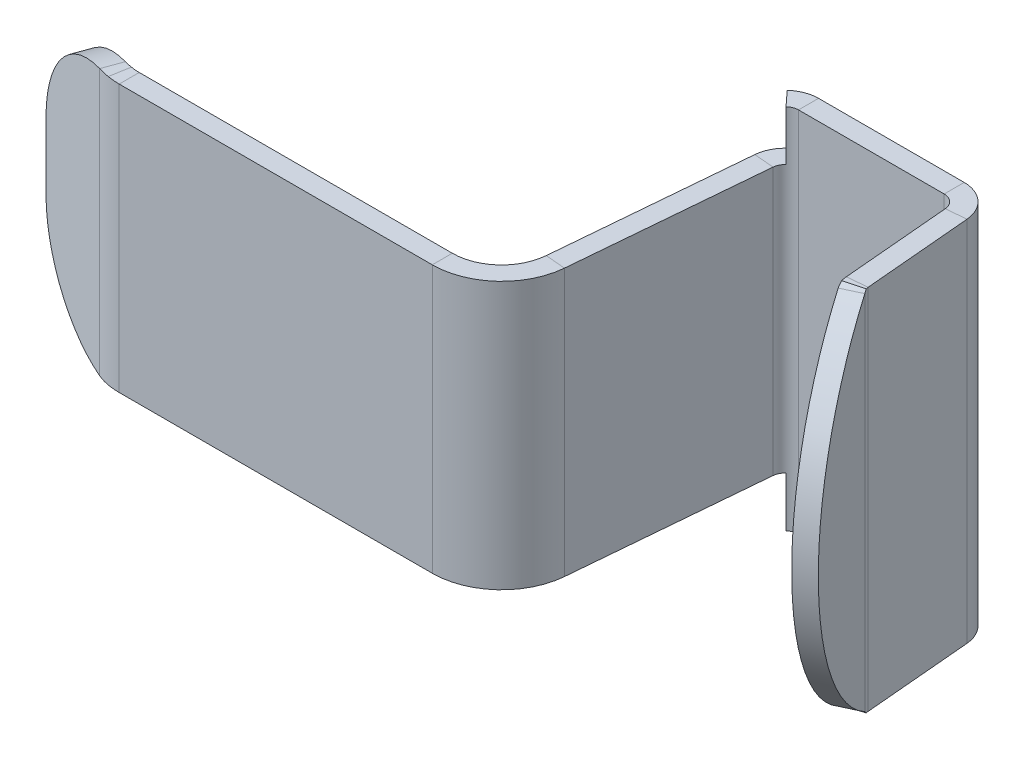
ISO-10303-21;
HEADER;
FILE_DESCRIPTION(('STEP AP214'),'2;1');
FILE_NAME('part.step','',(''),(''),'','','');
FILE_SCHEMA(('AUTOMOTIVE_DESIGN { 1 0 10303 214 1 1 1 1 }'));
ENDSEC;
DATA;
#1=APPLICATION_CONTEXT('core data for automotive mechanical design processes');
#2=APPLICATION_PROTOCOL_DEFINITION('international standard','automotive_design',2000,#1);
#3=PRODUCT_CONTEXT('',#1,'mechanical');
#4=PRODUCT('Part','Part','',(#3));
#5=PRODUCT_RELATED_PRODUCT_CATEGORY('part','',(#4));
#6=PRODUCT_DEFINITION_FORMATION('','',#4);
#7=PRODUCT_DEFINITION_CONTEXT('part definition',#1,'design');
#8=PRODUCT_DEFINITION('design','',#6,#7);
#9=PRODUCT_DEFINITION_SHAPE('','',#8);
#10=(LENGTH_UNIT() NAMED_UNIT(*) SI_UNIT(.MILLI.,.METRE.));
#11=(NAMED_UNIT(*) PLANE_ANGLE_UNIT() SI_UNIT($,.RADIAN.));
#12=(NAMED_UNIT(*) SI_UNIT($,.STERADIAN.) SOLID_ANGLE_UNIT());
#13=UNCERTAINTY_MEASURE_WITH_UNIT(LENGTH_MEASURE(1.E-05),#10,'distance_accuracy_value','');
#14=(GEOMETRIC_REPRESENTATION_CONTEXT(3) GLOBAL_UNCERTAINTY_ASSIGNED_CONTEXT((#13)) GLOBAL_UNIT_ASSIGNED_CONTEXT((#10,
#11,#12)) REPRESENTATION_CONTEXT('',''));
#15=CARTESIAN_POINT('',(0.,0.,0.));
#16=DIRECTION('',(0.,0.,1.));
#17=DIRECTION('',(1.,0.,0.));
#18=AXIS2_PLACEMENT_3D('',#15,#16,#17);
#19=CARTESIAN_POINT('',(9.61823899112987,2.,-3.38747435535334));
#20=DIRECTION('',(0.906307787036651,0.,-0.422618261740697));
#21=DIRECTION('',(-0.422618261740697,0.,-0.906307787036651));
#22=AXIS2_PLACEMENT_3D('',#19,#20,#21);
#23=CYLINDRICAL_SURFACE('',#22,3.27083333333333);
#24=CARTESIAN_POINT('',(10.3924417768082,4.70969008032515,-1.72719112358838));
#25=CARTESIAN_POINT('',(10.6643341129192,4.70969008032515,-1.8539766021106));
#26=B_SPLINE_CURVE_WITH_KNOTS('',1,(#24,#25),.UNSPECIFIED.,.F.,.F.,(2,2),(0.,1.),.UNSPECIFIED.);
#27=CARTESIAN_POINT('',(10.3924417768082,4.70969008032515,-1.72719112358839));
#28=VERTEX_POINT('',#27);
#29=CARTESIAN_POINT('',(10.6643341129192,4.70969008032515,-1.8539766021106));
#30=VERTEX_POINT('',#29);
#31=EDGE_CURVE('E242',#28,#30,#26,.T.);
#32=ORIENTED_EDGE('',*,*,#31,.F.);
#33=CARTESIAN_POINT('',(9.61823899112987,2.,-3.38747435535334));
#34=DIRECTION('',(-0.906307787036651,0.,0.422618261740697));
#35=DIRECTION('',(-0.422618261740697,0.,-0.906307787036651));
#36=AXIS2_PLACEMENT_3D('',#33,#34,#35);
#37=CIRCLE('',#36,3.27083333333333);
#38=CARTESIAN_POINT('',(10.3924417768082,-0.70969008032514,-1.72719112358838));
#39=VERTEX_POINT('',#38);
#40=EDGE_CURVE('E43',#39,#28,#37,.T.);
#41=ORIENTED_EDGE('',*,*,#40,.F.);
#42=CARTESIAN_POINT('',(10.6643341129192,-0.709690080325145,-1.85397660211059));
#43=CARTESIAN_POINT('',(10.3924417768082,-0.709690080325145,-1.72719112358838));
#44=B_SPLINE_CURVE_WITH_KNOTS('',1,(#42,#43),.UNSPECIFIED.,.F.,.F.,(2,2),(0.,1.),.UNSPECIFIED.);
#45=CARTESIAN_POINT('',(10.6643341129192,-0.709690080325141,-1.85397660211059));
#46=VERTEX_POINT('',#45);
#47=EDGE_CURVE('E52',#46,#39,#44,.T.);
#48=ORIENTED_EDGE('',*,*,#47,.F.);
#49=CARTESIAN_POINT('',(9.89013132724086,2.,-3.51425983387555));
#50=DIRECTION('',(-0.906307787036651,0.,0.422618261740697));
#51=DIRECTION('',(-0.422618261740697,0.,-0.906307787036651));
#52=AXIS2_PLACEMENT_3D('',#49,#50,#51);
#53=CIRCLE('',#52,3.27083333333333);
#54=EDGE_CURVE('E293',#46,#30,#53,.T.);
#55=ORIENTED_EDGE('',*,*,#54,.T.);
#56=EDGE_LOOP('',(#32,#41,#48,#55));
#57=FACE_BOUND('',#56,.T.);
#58=ADVANCED_FACE('F31',(#57),#23,.T.);
#59=CARTESIAN_POINT('',(9.61823899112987,2.,-3.38747435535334));
#60=DIRECTION('',(0.906307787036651,0.,-0.422618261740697));
#61=DIRECTION('',(-0.422618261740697,0.,-0.906307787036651));
#62=AXIS2_PLACEMENT_3D('',#59,#60,#61);
#63=PLANE('',#62);
#64=DIRECTION('',(0.,1.,0.));
#65=VECTOR('',#64,1.);
#66=CARTESIAN_POINT('',(10.3924417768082,2.,-1.72719112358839));
#67=LINE('',#66,#65);
#68=EDGE_CURVE('E296',#39,#28,#67,.T.);
#69=ORIENTED_EDGE('',*,*,#68,.F.);
#70=ORIENTED_EDGE('',*,*,#40,.T.);
#71=EDGE_LOOP('',(#69,#70));
#72=FACE_BOUND('',#71,.T.);
#73=ADVANCED_FACE('F312',(#72),#63,.F.);
#74=CARTESIAN_POINT('',(9.89013132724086,2.,-3.51425983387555));
#75=DIRECTION('',(0.906307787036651,0.,-0.422618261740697));
#76=DIRECTION('',(-0.422618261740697,0.,-0.906307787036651));
#77=AXIS2_PLACEMENT_3D('',#74,#75,#76);
#78=PLANE('',#77);
#79=ORIENTED_EDGE('',*,*,#54,.F.);
#80=DIRECTION('',(0.,1.,0.));
#81=VECTOR('',#80,1.);
#82=CARTESIAN_POINT('',(10.6643341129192,2.,-1.85397660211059));
#83=LINE('',#82,#81);
#84=EDGE_CURVE('E11',#46,#30,#83,.T.);
#85=ORIENTED_EDGE('',*,*,#84,.T.);
#86=EDGE_LOOP('',(#79,#85));
#87=FACE_BOUND('',#86,.T.);
#88=ADVANCED_FACE('F33',(#87),#78,.T.);
#89=CARTESIAN_POINT('',(10.4973424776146,2.,-3.62430981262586));
#90=DIRECTION('',(0.996194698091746,0.,-0.0871557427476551));
#91=DIRECTION('',(-0.0871557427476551,0.,-0.996194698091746));
#92=AXIS2_PLACEMENT_3D('',#89,#90,#91);
#93=PLANE('',#92);
#94=DIRECTION('',(0.,1.,0.));
#95=VECTOR('',#94,1.);
#96=CARTESIAN_POINT('',(10.6463567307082,2.,-1.9210691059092));
#97=LINE('',#96,#95);
#98=CARTESIAN_POINT('',(10.6463567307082,-0.749999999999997,-1.9210691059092));
#99=VERTEX_POINT('',#98);
#100=CARTESIAN_POINT('',(10.6463567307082,4.75,-1.9210691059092));
#101=VERTEX_POINT('',#100);
#102=EDGE_CURVE('E249',#99,#101,#97,.T.);
#103=ORIENTED_EDGE('',*,*,#102,.F.);
#104=DIRECTION('',(0.0871557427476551,0.,0.996194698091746));
#105=VECTOR('',#104,1.);
#106=CARTESIAN_POINT('',(10.246406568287,-0.750000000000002,-6.49252038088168));
#107=LINE('',#106,#105);
#108=CARTESIAN_POINT('',(10.504354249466,-0.749999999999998,-3.54416489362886));
#109=VERTEX_POINT('',#108);
#110=EDGE_CURVE('E243',#109,#99,#107,.T.);
#111=ORIENTED_EDGE('',*,*,#110,.F.);
#112=DIRECTION('',(0.,1.,0.));
#113=VECTOR('',#112,1.);
#114=CARTESIAN_POINT('',(10.504354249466,2.,-3.54416489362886));
#115=LINE('',#114,#113);
#116=CARTESIAN_POINT('',(10.504354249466,4.75,-3.54416489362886));
#117=VERTEX_POINT('',#116);
#118=EDGE_CURVE('E264',#109,#117,#115,.T.);
#119=ORIENTED_EDGE('',*,*,#118,.T.);
#120=DIRECTION('',(-0.0871557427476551,0.,-0.996194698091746));
#121=VECTOR('',#120,1.);
#122=CARTESIAN_POINT('',(10.246406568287,4.75,-6.49252038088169));
#123=LINE('',#122,#121);
#124=EDGE_CURVE('E263',#101,#117,#123,.T.);
#125=ORIENTED_EDGE('',*,*,#124,.F.);
#126=EDGE_LOOP('',(#103,#111,#119,#125));
#127=FACE_BOUND('',#126,.T.);
#128=ADVANCED_FACE('F260',(#127),#93,.T.);
#129=CARTESIAN_POINT('',(9.94754815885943,4.75,-6.46637365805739));
#130=DIRECTION('',(0.,-1.,0.));
#131=DIRECTION('',(0.996194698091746,0.,-0.0871557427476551));
#132=AXIS2_PLACEMENT_3D('',#129,#130,#131);
#133=PLANE('',#132);
#134=DIRECTION('',(-0.0871557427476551,0.,-0.996194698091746));
#135=VECTOR('',#134,1.);
#136=CARTESIAN_POINT('',(9.94754815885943,4.75,-6.46637365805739));
#137=LINE('',#136,#135);
#138=CARTESIAN_POINT('',(10.3474983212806,4.75,-1.89492238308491));
#139=VERTEX_POINT('',#138);
#140=CARTESIAN_POINT('',(10.2054958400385,4.75,-3.51801817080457));
#141=VERTEX_POINT('',#140);
#142=EDGE_CURVE('E270',#139,#141,#137,.T.);
#143=ORIENTED_EDGE('',*,*,#142,.F.);
#144=DIRECTION('',(0.996194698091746,0.,-0.0871557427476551));
#145=VECTOR('',#144,1.);
#146=CARTESIAN_POINT('',(10.3474983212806,4.75,-1.89492238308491));
#147=LINE('',#146,#145);
#148=EDGE_CURVE('E281',#139,#101,#147,.T.);
#149=ORIENTED_EDGE('',*,*,#148,.T.);
#150=ORIENTED_EDGE('',*,*,#124,.T.);
#151=DIRECTION('',(0.996194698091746,0.,-0.0871557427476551));
#152=VECTOR('',#151,1.);
#153=CARTESIAN_POINT('',(10.2054958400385,4.75,-3.51801817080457));
#154=LINE('',#153,#152);
#155=EDGE_CURVE('E265',#141,#117,#154,.T.);
#156=ORIENTED_EDGE('',*,*,#155,.F.);
#157=EDGE_LOOP('',(#143,#149,#150,#156));
#158=FACE_BOUND('',#157,.T.);
#159=ADVANCED_FACE('F463',(#158),#133,.F.);
#160=CARTESIAN_POINT('',(10.1984840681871,2.,-3.59816308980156));
#161=DIRECTION('',(0.996194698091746,0.,-0.0871557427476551));
#162=DIRECTION('',(-0.0871557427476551,0.,-0.996194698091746));
#163=AXIS2_PLACEMENT_3D('',#160,#161,#162);
#164=PLANE('',#163);
#165=DIRECTION('',(0.0871557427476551,0.,0.996194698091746));
#166=VECTOR('',#165,1.);
#167=CARTESIAN_POINT('',(9.94754815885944,-0.750000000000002,-6.46637365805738));
#168=LINE('',#167,#166);
#169=CARTESIAN_POINT('',(10.2054958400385,-0.749999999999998,-3.51801817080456));
#170=VERTEX_POINT('',#169);
#171=CARTESIAN_POINT('',(10.3474983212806,-0.749999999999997,-1.8949223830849));
#172=VERTEX_POINT('',#171);
#173=EDGE_CURVE('E278',#170,#172,#168,.T.);
#174=ORIENTED_EDGE('',*,*,#173,.T.);
#175=DIRECTION('',(0.,1.,0.));
#176=VECTOR('',#175,1.);
#177=CARTESIAN_POINT('',(10.3474983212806,2.,-1.8949223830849));
#178=LINE('',#177,#176);
#179=EDGE_CURVE('E272',#172,#139,#178,.T.);
#180=ORIENTED_EDGE('',*,*,#179,.T.);
#181=ORIENTED_EDGE('',*,*,#142,.T.);
#182=DIRECTION('',(0.,1.,0.));
#183=VECTOR('',#182,1.);
#184=CARTESIAN_POINT('',(10.2054958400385,2.,-3.51801817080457));
#185=LINE('',#184,#183);
#186=EDGE_CURVE('E287',#170,#141,#185,.T.);
#187=ORIENTED_EDGE('',*,*,#186,.F.);
#188=EDGE_LOOP('',(#174,#180,#181,#187));
#189=FACE_BOUND('',#188,.T.);
#190=ADVANCED_FACE('F461',(#189),#164,.F.);
#191=CARTESIAN_POINT('',(9.94754815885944,-0.750000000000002,-6.46637365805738));
#192=DIRECTION('',(0.,1.,0.));
#193=DIRECTION('',(-0.0871557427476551,0.,-0.996194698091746));
#194=AXIS2_PLACEMENT_3D('',#191,#192,#193);
#195=PLANE('',#194);
#196=ORIENTED_EDGE('',*,*,#110,.T.);
#197=DIRECTION('',(-0.996194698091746,0.,0.0871557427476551));
#198=VECTOR('',#197,1.);
#199=CARTESIAN_POINT('',(10.3474983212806,-0.749999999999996,-1.8949223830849));
#200=LINE('',#199,#198);
#201=EDGE_CURVE('E231',#99,#172,#200,.T.);
#202=ORIENTED_EDGE('',*,*,#201,.T.);
#203=ORIENTED_EDGE('',*,*,#173,.F.);
#204=DIRECTION('',(-0.996194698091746,0.,0.0871557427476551));
#205=VECTOR('',#204,1.);
#206=CARTESIAN_POINT('',(10.2054958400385,-0.749999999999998,-3.51801817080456));
#207=LINE('',#206,#205);
#208=EDGE_CURVE('E269',#109,#170,#207,.T.);
#209=ORIENTED_EDGE('',*,*,#208,.F.);
#210=EDGE_LOOP('',(#196,#202,#203,#209));
#211=FACE_BOUND('',#210,.T.);
#212=ADVANCED_FACE('F267',(#211),#195,.F.);
#213=CARTESIAN_POINT('',(10.445041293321,2.,-3.70058702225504));
#214=DIRECTION('',(0.,0.,-1.));
#215=DIRECTION('',(-1.,0.,0.));
#216=AXIS2_PLACEMENT_3D('',#213,#214,#215);
#217=PLANE('',#216);
#218=DIRECTION('',(1.,0.,0.));
#219=VECTOR('',#218,1.);
#220=CARTESIAN_POINT('',(7.5658746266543,-0.75,-3.70058702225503));
#221=LINE('',#220,#219);
#222=CARTESIAN_POINT('',(7.82549235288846,-0.750000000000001,-3.70058702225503));
#223=VERTEX_POINT('',#222);
#224=CARTESIAN_POINT('',(10.0062569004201,-0.749999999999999,-3.70058702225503));
#225=VERTEX_POINT('',#224);
#226=EDGE_CURVE('E720',#223,#225,#221,.T.);
#227=ORIENTED_EDGE('',*,*,#226,.T.);
#228=DIRECTION('',(0.,1.,0.));
#229=VECTOR('',#228,1.);
#230=CARTESIAN_POINT('',(10.0062569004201,2.,-3.70058702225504));
#231=LINE('',#230,#229);
#232=CARTESIAN_POINT('',(10.0062569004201,4.75,-3.70058702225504));
#233=VERTEX_POINT('',#232);
#234=EDGE_CURVE('E709',#225,#233,#231,.T.);
#235=ORIENTED_EDGE('',*,*,#234,.T.);
#236=DIRECTION('',(-1.,0.,0.));
#237=VECTOR('',#236,1.);
#238=CARTESIAN_POINT('',(7.5658746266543,4.75,-3.70058702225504));
#239=LINE('',#238,#237);
#240=CARTESIAN_POINT('',(7.82549235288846,4.75,-3.70058702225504));
#241=VERTEX_POINT('',#240);
#242=EDGE_CURVE('E698',#233,#241,#239,.T.);
#243=ORIENTED_EDGE('',*,*,#242,.T.);
#244=DIRECTION('',(0.,1.,0.));
#245=VECTOR('',#244,1.);
#246=CARTESIAN_POINT('',(7.82549235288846,2.,-3.70058702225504));
#247=LINE('',#246,#245);
#248=EDGE_CURVE('E697',#223,#241,#247,.T.);
#249=ORIENTED_EDGE('',*,*,#248,.F.);
#250=EDGE_LOOP('',(#227,#235,#243,#249));
#251=FACE_BOUND('',#250,.T.);
#252=ADVANCED_FACE('F746',(#251),#217,.F.);
#253=CARTESIAN_POINT('',(7.5658746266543,-0.75,-3.70058702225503));
#254=DIRECTION('',(0.,1.,0.));
#255=DIRECTION('',(-1.,0.,0.));
#256=AXIS2_PLACEMENT_3D('',#253,#254,#255);
#257=PLANE('',#256);
#258=DIRECTION('',(1.,0.,0.));
#259=VECTOR('',#258,1.);
#260=CARTESIAN_POINT('',(7.5658746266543,-0.75,-4.00058702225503));
#261=LINE('',#260,#259);
#262=CARTESIAN_POINT('',(7.82549235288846,-0.750000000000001,-4.00058702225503));
#263=VERTEX_POINT('',#262);
#264=CARTESIAN_POINT('',(10.0062569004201,-0.749999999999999,-4.00058702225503));
#265=VERTEX_POINT('',#264);
#266=EDGE_CURVE('E713',#263,#265,#261,.T.);
#267=ORIENTED_EDGE('',*,*,#266,.T.);
#268=DIRECTION('',(0.,0.,1.));
#269=VECTOR('',#268,1.);
#270=CARTESIAN_POINT('',(10.0062569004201,-0.749999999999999,-3.70058702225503));
#271=LINE('',#270,#269);
#272=EDGE_CURVE('E706',#265,#225,#271,.T.);
#273=ORIENTED_EDGE('',*,*,#272,.T.);
#274=ORIENTED_EDGE('',*,*,#226,.F.);
#275=DIRECTION('',(0.,0.,1.));
#276=VECTOR('',#275,1.);
#277=CARTESIAN_POINT('',(7.82549235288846,-0.75,-3.70058702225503));
#278=LINE('',#277,#276);
#279=EDGE_CURVE('E700',#263,#223,#278,.T.);
#280=ORIENTED_EDGE('',*,*,#279,.F.);
#281=EDGE_LOOP('',(#267,#273,#274,#280));
#282=FACE_BOUND('',#281,.T.);
#283=ADVANCED_FACE('F743',(#282),#257,.F.);
#284=CARTESIAN_POINT('',(7.5658746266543,4.75,-3.70058702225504));
#285=DIRECTION('',(0.,-1.,0.));
#286=DIRECTION('',(0.,0.,-1.));
#287=AXIS2_PLACEMENT_3D('',#284,#285,#286);
#288=PLANE('',#287);
#289=ORIENTED_EDGE('',*,*,#242,.F.);
#290=DIRECTION('',(0.,0.,-1.));
#291=VECTOR('',#290,1.);
#292=CARTESIAN_POINT('',(10.0062569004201,4.75,-3.70058702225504));
#293=LINE('',#292,#291);
#294=CARTESIAN_POINT('',(10.0062569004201,4.75,-4.00058702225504));
#295=VERTEX_POINT('',#294);
#296=EDGE_CURVE('E476',#233,#295,#293,.T.);
#297=ORIENTED_EDGE('',*,*,#296,.T.);
#298=DIRECTION('',(-1.,0.,0.));
#299=VECTOR('',#298,1.);
#300=CARTESIAN_POINT('',(7.5658746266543,4.75,-4.00058702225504));
#301=LINE('',#300,#299);
#302=CARTESIAN_POINT('',(7.82549235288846,4.75,-4.00058702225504));
#303=VERTEX_POINT('',#302);
#304=EDGE_CURVE('E716',#295,#303,#301,.T.);
#305=ORIENTED_EDGE('',*,*,#304,.T.);
#306=DIRECTION('',(0.,0.,-1.));
#307=VECTOR('',#306,1.);
#308=CARTESIAN_POINT('',(7.82549235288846,4.75,-3.70058702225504));
#309=LINE('',#308,#307);
#310=EDGE_CURVE('E702',#241,#303,#309,.T.);
#311=ORIENTED_EDGE('',*,*,#310,.F.);
#312=EDGE_LOOP('',(#289,#297,#305,#311));
#313=FACE_BOUND('',#312,.T.);
#314=ADVANCED_FACE('F727',(#313),#288,.F.);
#315=CARTESIAN_POINT('',(10.445041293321,2.,-4.00058702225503));
#316=DIRECTION('',(0.,0.,-1.));
#317=DIRECTION('',(-1.,0.,0.));
#318=AXIS2_PLACEMENT_3D('',#315,#316,#317);
#319=PLANE('',#318);
#320=DIRECTION('',(0.,1.,0.));
#321=VECTOR('',#320,1.);
#322=CARTESIAN_POINT('',(10.0062569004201,2.,-4.00058702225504));
#323=LINE('',#322,#321);
#324=EDGE_CURVE('E291',#265,#295,#323,.T.);
#325=ORIENTED_EDGE('',*,*,#324,.F.);
#326=ORIENTED_EDGE('',*,*,#266,.F.);
#327=DIRECTION('',(0.,1.,0.));
#328=VECTOR('',#327,1.);
#329=CARTESIAN_POINT('',(7.82549235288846,2.,-4.00058702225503));
#330=LINE('',#329,#328);
#331=EDGE_CURVE('E694',#263,#303,#330,.T.);
#332=ORIENTED_EDGE('',*,*,#331,.T.);
#333=ORIENTED_EDGE('',*,*,#304,.F.);
#334=EDGE_LOOP('',(#325,#326,#332,#333));
#335=FACE_BOUND('',#334,.T.);
#336=ADVANCED_FACE('F557',(#335),#319,.T.);
#337=CARTESIAN_POINT('',(1.44561168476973,1.5,0.290409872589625));
#338=DIRECTION('',(0.342020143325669,0.,-0.939692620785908));
#339=DIRECTION('',(-0.939692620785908,0.,-0.342020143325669));
#340=AXIS2_PLACEMENT_3D('',#337,#338,#339);
#341=CYLINDRICAL_SURFACE('',#340,1.5);
#342=CARTESIAN_POINT('',(1.30020281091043,0.0080029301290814,0.237485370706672));
#343=CARTESIAN_POINT('',(1.40280885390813,0.0080029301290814,-0.0444224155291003));
#344=B_SPLINE_CURVE_WITH_KNOTS('',1,(#342,#343),.UNSPECIFIED.,.F.,.F.,(2,2),(0.,1.),.UNSPECIFIED.);
#345=CARTESIAN_POINT('',(1.30020281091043,0.0080029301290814,0.237485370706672));
#346=VERTEX_POINT('',#345);
#347=CARTESIAN_POINT('',(1.40280885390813,0.00800293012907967,-0.0444224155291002));
#348=VERTEX_POINT('',#347);
#349=EDGE_CURVE('E539',#346,#348,#344,.T.);
#350=ORIENTED_EDGE('',*,*,#349,.F.);
#351=CARTESIAN_POINT('',(1.44561168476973,1.5,0.290409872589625));
#352=DIRECTION('',(-0.342020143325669,0.,0.939692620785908));
#353=DIRECTION('',(-0.939692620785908,0.,-0.342020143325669));
#354=AXIS2_PLACEMENT_3D('',#351,#352,#353);
#355=CIRCLE('',#354,1.5);
#356=CARTESIAN_POINT('',(0.0360727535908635,1.5,-0.222620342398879));
#357=VERTEX_POINT('',#356);
#358=EDGE_CURVE('E661',#357,#346,#355,.T.);
#359=ORIENTED_EDGE('',*,*,#358,.F.);
#360=DIRECTION('',(0.342020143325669,0.,-0.939692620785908));
#361=VECTOR('',#360,1.);
#362=CARTESIAN_POINT('',(0.0360727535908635,1.5,-0.222620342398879));
#363=LINE('',#362,#361);
#364=CARTESIAN_POINT('',(0.138678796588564,1.5,-0.504528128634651));
#365=VERTEX_POINT('',#364);
#366=EDGE_CURVE('E687',#357,#365,#363,.T.);
#367=ORIENTED_EDGE('',*,*,#366,.T.);
#368=CARTESIAN_POINT('',(1.54821772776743,1.5,0.00850208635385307));
#369=DIRECTION('',(-0.342020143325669,0.,0.939692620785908));
#370=DIRECTION('',(-0.939692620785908,0.,-0.342020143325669));
#371=AXIS2_PLACEMENT_3D('',#368,#369,#370);
#372=CIRCLE('',#371,1.5);
#373=EDGE_CURVE('E685',#365,#348,#372,.T.);
#374=ORIENTED_EDGE('',*,*,#373,.T.);
#375=EDGE_LOOP('',(#350,#359,#367,#374));
#376=FACE_BOUND('',#375,.T.);
#377=ADVANCED_FACE('F546',(#376),#341,.T.);
#378=CARTESIAN_POINT('',(0.0360727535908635,1.5,-0.222620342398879));
#379=DIRECTION('',(0.939692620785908,0.,0.342020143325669));
#380=DIRECTION('',(0.342020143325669,0.,-0.939692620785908));
#381=AXIS2_PLACEMENT_3D('',#378,#379,#380);
#382=PLANE('',#381);
#383=DIRECTION('',(0.,-1.,0.));
#384=VECTOR('',#383,1.);
#385=CARTESIAN_POINT('',(0.138678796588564,1.5,-0.504528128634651));
#386=LINE('',#385,#384);
#387=CARTESIAN_POINT('',(0.138678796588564,2.5,-0.504528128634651));
#388=VERTEX_POINT('',#387);
#389=EDGE_CURVE('E683',#388,#365,#386,.T.);
#390=ORIENTED_EDGE('',*,*,#389,.T.);
#391=ORIENTED_EDGE('',*,*,#366,.F.);
#392=DIRECTION('',(0.,-1.,0.));
#393=VECTOR('',#392,1.);
#394=CARTESIAN_POINT('',(0.0360727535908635,1.5,-0.222620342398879));
#395=LINE('',#394,#393);
#396=CARTESIAN_POINT('',(0.0360727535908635,2.5,-0.222620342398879));
#397=VERTEX_POINT('',#396);
#398=EDGE_CURVE('E664',#397,#357,#395,.T.);
#399=ORIENTED_EDGE('',*,*,#398,.F.);
#400=DIRECTION('',(0.342020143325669,0.,-0.939692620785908));
#401=VECTOR('',#400,1.);
#402=CARTESIAN_POINT('',(0.0360727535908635,2.5,-0.222620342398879));
#403=LINE('',#402,#401);
#404=EDGE_CURVE('E678',#397,#388,#403,.T.);
#405=ORIENTED_EDGE('',*,*,#404,.T.);
#406=EDGE_LOOP('',(#390,#391,#399,#405));
#407=FACE_BOUND('',#406,.T.);
#408=ADVANCED_FACE('F556',(#407),#382,.F.);
#409=CARTESIAN_POINT('',(1.44561168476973,2.5,0.290409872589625));
#410=DIRECTION('',(0.342020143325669,0.,-0.939692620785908));
#411=DIRECTION('',(-0.939692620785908,0.,-0.342020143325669));
#412=AXIS2_PLACEMENT_3D('',#409,#410,#411);
#413=CYLINDRICAL_SURFACE('',#412,1.5);
#414=CARTESIAN_POINT('',(1.40280885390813,3.99199706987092,-0.0444224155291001));
#415=CARTESIAN_POINT('',(1.30020281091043,3.99199706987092,0.237485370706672));
#416=B_SPLINE_CURVE_WITH_KNOTS('',1,(#414,#415),.UNSPECIFIED.,.F.,.F.,(2,2),(0.,1.),.UNSPECIFIED.);
#417=CARTESIAN_POINT('',(1.40280885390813,3.99199706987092,-0.0444224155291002));
#418=VERTEX_POINT('',#417);
#419=CARTESIAN_POINT('',(1.30020281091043,3.99199706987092,0.237485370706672));
#420=VERTEX_POINT('',#419);
#421=EDGE_CURVE('E658',#418,#420,#416,.T.);
#422=ORIENTED_EDGE('',*,*,#421,.F.);
#423=CARTESIAN_POINT('',(1.54821772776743,2.5,0.00850208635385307));
#424=DIRECTION('',(-0.342020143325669,0.,0.939692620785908));
#425=DIRECTION('',(-0.939692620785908,0.,-0.342020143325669));
#426=AXIS2_PLACEMENT_3D('',#423,#424,#425);
#427=CIRCLE('',#426,1.5);
#428=EDGE_CURVE('E674',#418,#388,#427,.T.);
#429=ORIENTED_EDGE('',*,*,#428,.T.);
#430=ORIENTED_EDGE('',*,*,#404,.F.);
#431=CARTESIAN_POINT('',(1.44561168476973,2.5,0.290409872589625));
#432=DIRECTION('',(-0.342020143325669,0.,0.939692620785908));
#433=DIRECTION('',(-0.939692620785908,0.,-0.342020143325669));
#434=AXIS2_PLACEMENT_3D('',#431,#432,#433);
#435=CIRCLE('',#434,1.5);
#436=EDGE_CURVE('E668',#420,#397,#435,.T.);
#437=ORIENTED_EDGE('',*,*,#436,.F.);
#438=EDGE_LOOP('',(#422,#429,#430,#437));
#439=FACE_BOUND('',#438,.T.);
#440=ADVANCED_FACE('F562',(#439),#413,.T.);
#441=CARTESIAN_POINT('',(12.9928907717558,2.,4.1740224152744));
#442=DIRECTION('',(0.342020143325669,0.,-0.939692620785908));
#443=DIRECTION('',(-0.939692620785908,0.,-0.342020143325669));
#444=AXIS2_PLACEMENT_3D('',#441,#442,#443);
#445=PLANE('',#444);
#446=ORIENTED_EDGE('',*,*,#428,.F.);
#447=DIRECTION('',(0.,-1.,0.));
#448=VECTOR('',#447,1.);
#449=CARTESIAN_POINT('',(1.40280885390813,2.,-0.0444224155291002));
#450=LINE('',#449,#448);
#451=EDGE_CURVE('E672',#418,#348,#450,.T.);
#452=ORIENTED_EDGE('',*,*,#451,.T.);
#453=ORIENTED_EDGE('',*,*,#373,.F.);
#454=ORIENTED_EDGE('',*,*,#389,.F.);
#455=EDGE_LOOP('',(#446,#452,#453,#454));
#456=FACE_BOUND('',#455,.T.);
#457=ADVANCED_FACE('F567',(#456),#445,.T.);
#458=CARTESIAN_POINT('',(1.30020281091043,0.0080029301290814,0.237485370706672));
#459=CARTESIAN_POINT('',(1.36466611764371,0.00300327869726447,0.260948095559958));
#460=CARTESIAN_POINT('',(1.42353286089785,0.000336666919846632,0.275223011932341));
#461=CARTESIAN_POINT('',(1.47473719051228,0.,0.284251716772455));
#462=CARTESIAN_POINT('',(1.40280885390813,0.0080029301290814,-0.0444224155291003));
#463=CARTESIAN_POINT('',(1.44861584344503,0.00300329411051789,-0.0277500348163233));
#464=CARTESIAN_POINT('',(1.49044634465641,0.000336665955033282,-0.0176063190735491));
#465=CARTESIAN_POINT('',(1.52683164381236,0.,-0.0111906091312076));
#466=B_SPLINE_SURFACE_WITH_KNOTS('',1,3,((#458,#459,#460,#461),(#462,#463,#464,#465)),
.UNSPECIFIED.,.F.,.F.,.F.,(2,2),(4,4),(0.,1.),(0.,1.),.UNSPECIFIED.);
#467=CARTESIAN_POINT('',(1.40280885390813,0.0080029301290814,-0.0444224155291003));
#468=CARTESIAN_POINT('',(1.44861584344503,0.00300329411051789,-0.0277500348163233));
#469=CARTESIAN_POINT('',(1.49044634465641,0.000336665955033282,-0.0176063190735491));
#470=CARTESIAN_POINT('',(1.52683164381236,0.,-0.0111906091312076));
#471=B_SPLINE_CURVE_WITH_KNOTS('',3,(#467,#468,#469,#470),.UNSPECIFIED.,.F.,.F.,(4,4),(0.,1.),.UNSPECIFIED.);
#472=CARTESIAN_POINT('',(1.52683164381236,0.,-0.0111906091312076));
#473=VERTEX_POINT('',#472);
#474=EDGE_CURVE('E929',#348,#473,#471,.T.);
#475=CARTESIAN_POINT('',(1.52683164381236,0.,-0.0111906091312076));
#476=CARTESIAN_POINT('',(1.47473719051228,0.,0.284251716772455));
#477=B_SPLINE_CURVE_WITH_KNOTS('',1,(#475,#476),.UNSPECIFIED.,.F.,.F.,(2,2),(0.,1.),.UNSPECIFIED.);
#478=CARTESIAN_POINT('',(1.47473719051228,0.,0.284251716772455));
#479=VERTEX_POINT('',#478);
#480=EDGE_CURVE('E626',#473,#479,#477,.T.);
#481=CARTESIAN_POINT('',(1.47473719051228,0.,0.284251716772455));
#482=CARTESIAN_POINT('',(1.42353286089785,0.000336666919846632,0.275223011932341));
#483=CARTESIAN_POINT('',(1.36466611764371,0.00300327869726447,0.260948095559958));
#484=CARTESIAN_POINT('',(1.30020281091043,0.0080029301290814,0.237485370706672));
#485=B_SPLINE_CURVE_WITH_KNOTS('',3,(#481,#482,#483,#484),.UNSPECIFIED.,.F.,.F.,(4,4),(0.,1.),.UNSPECIFIED.);
#486=EDGE_CURVE('E625',#346,#479,#485,.F.);
#487=ORIENTED_EDGE('',*,*,#349,.T.);
#488=ORIENTED_EDGE('',*,*,#474,.T.);
#489=ORIENTED_EDGE('',*,*,#480,.T.);
#490=ORIENTED_EDGE('',*,*,#486,.F.);
#491=EDGE_LOOP('',(#487,#488,#489,#490));
#492=FACE_BOUND('',#491,.T.);
#493=ADVANCED_FACE('F587',(#492),#466,.T.);
#494=CARTESIAN_POINT('',(12.8902847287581,2.,4.45593020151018));
#495=DIRECTION('',(0.342020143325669,0.,-0.939692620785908));
#496=DIRECTION('',(-0.939692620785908,0.,-0.342020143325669));
#497=AXIS2_PLACEMENT_3D('',#494,#495,#496);
#498=PLANE('',#497);
#499=DIRECTION('',(0.,-1.,0.));
#500=VECTOR('',#499,1.);
#501=CARTESIAN_POINT('',(1.30020281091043,2.,0.237485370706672));
#502=LINE('',#501,#500);
#503=EDGE_CURVE('E631',#420,#346,#502,.T.);
#504=ORIENTED_EDGE('',*,*,#503,.F.);
#505=ORIENTED_EDGE('',*,*,#436,.T.);
#506=ORIENTED_EDGE('',*,*,#398,.T.);
#507=ORIENTED_EDGE('',*,*,#358,.T.);
#508=EDGE_LOOP('',(#504,#505,#506,#507));
#509=FACE_BOUND('',#508,.T.);
#510=ADVANCED_FACE('F598',(#509),#498,.F.);
#511=CARTESIAN_POINT('',(1.47473719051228,4.,0.284251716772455));
#512=CARTESIAN_POINT('',(1.40702796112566,3.99892464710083,0.272312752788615));
#513=CARTESIAN_POINT('',(1.34891771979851,3.99625425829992,0.255216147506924));
#514=CARTESIAN_POINT('',(1.30020281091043,3.99199706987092,0.237485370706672));
#515=CARTESIAN_POINT('',(1.52683164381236,4.,-0.0111906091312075));
#516=CARTESIAN_POINT('',(1.47871775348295,3.99892464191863,-0.0196743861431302));
#517=CARTESIAN_POINT('',(1.43742562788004,3.99625429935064,-0.0318229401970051));
#518=CARTESIAN_POINT('',(1.40280885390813,3.99199706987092,-0.0444224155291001));
#519=B_SPLINE_SURFACE_WITH_KNOTS('',1,3,((#511,#512,#513,#514),(#515,#516,#517,#518)),
.UNSPECIFIED.,.F.,.F.,.F.,(2,2),(4,4),(0.,1.),(0.,1.),.UNSPECIFIED.);
#520=CARTESIAN_POINT('',(1.52683164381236,4.,-0.0111906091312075));
#521=CARTESIAN_POINT('',(1.47871775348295,3.99892464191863,-0.0196743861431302));
#522=CARTESIAN_POINT('',(1.43742562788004,3.99625429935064,-0.0318229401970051));
#523=CARTESIAN_POINT('',(1.40280885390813,3.99199706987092,-0.0444224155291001));
#524=B_SPLINE_CURVE_WITH_KNOTS('',3,(#520,#521,#522,#523),.UNSPECIFIED.,.F.,.F.,(4,4),(0.,1.),.UNSPECIFIED.);
#525=CARTESIAN_POINT('',(1.52683164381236,4.,-0.0111906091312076));
#526=VERTEX_POINT('',#525);
#527=EDGE_CURVE('E663',#526,#418,#524,.T.);
#528=CARTESIAN_POINT('',(1.30020281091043,3.99199706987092,0.237485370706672));
#529=CARTESIAN_POINT('',(1.34891771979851,3.99625425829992,0.255216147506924));
#530=CARTESIAN_POINT('',(1.40702796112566,3.99892464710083,0.272312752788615));
#531=CARTESIAN_POINT('',(1.47473719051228,4.,0.284251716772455));
#532=B_SPLINE_CURVE_WITH_KNOTS('',3,(#528,#529,#530,#531),.UNSPECIFIED.,.F.,.F.,(4,4),(0.,1.),.UNSPECIFIED.);
#533=CARTESIAN_POINT('',(1.47473719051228,4.,0.284251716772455));
#534=VERTEX_POINT('',#533);
#535=EDGE_CURVE('E634',#534,#420,#532,.F.);
#536=CARTESIAN_POINT('',(1.47473719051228,4.,0.284251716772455));
#537=CARTESIAN_POINT('',(1.52683164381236,4.,-0.0111906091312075));
#538=B_SPLINE_CURVE_WITH_KNOTS('',1,(#536,#537),.UNSPECIFIED.,.F.,.F.,(2,2),(0.,1.),.UNSPECIFIED.);
#539=EDGE_CURVE('E645',#526,#534,#538,.F.);
#540=ORIENTED_EDGE('',*,*,#527,.T.);
#541=ORIENTED_EDGE('',*,*,#421,.T.);
#542=ORIENTED_EDGE('',*,*,#535,.F.);
#543=ORIENTED_EDGE('',*,*,#539,.F.);
#544=EDGE_LOOP('',(#540,#541,#542,#543));
#545=FACE_BOUND('',#544,.T.);
#546=ADVANCED_FACE('F944',(#545),#519,.T.);
#547=CARTESIAN_POINT('',(1.65474089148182,0.,-0.7366));
#548=DIRECTION('',(0.,-1.,0.));
#549=DIRECTION('',(0.,0.,-1.));
#550=AXIS2_PLACEMENT_3D('',#547,#548,#549);
#551=PLANE('',#550);
#552=ORIENTED_EDGE('',*,*,#480,.F.);
#553=CARTESIAN_POINT('',(1.65474089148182,0.,-0.7366));
#554=DIRECTION('',(0.,1.,0.));
#555=DIRECTION('',(0.,0.,1.));
#556=AXIS2_PLACEMENT_3D('',#553,#554,#555);
#557=CIRCLE('',#556,0.7366);
#558=CARTESIAN_POINT('',(1.65474089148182,0.,0.));
#559=VERTEX_POINT('',#558);
#560=EDGE_CURVE('E655',#473,#559,#557,.T.);
#561=ORIENTED_EDGE('',*,*,#560,.T.);
#562=DIRECTION('',(0.,0.,-1.));
#563=VECTOR('',#562,1.);
#564=CARTESIAN_POINT('',(1.65474089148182,0.,0.3));
#565=LINE('',#564,#563);
#566=CARTESIAN_POINT('',(1.65474089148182,0.,0.3));
#567=VERTEX_POINT('',#566);
#568=EDGE_CURVE('E827',#567,#559,#565,.T.);
#569=ORIENTED_EDGE('',*,*,#568,.F.);
#570=CARTESIAN_POINT('',(1.65474089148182,0.,-0.7366));
#571=DIRECTION('',(0.,1.,0.));
#572=DIRECTION('',(0.,0.,1.));
#573=AXIS2_PLACEMENT_3D('',#570,#571,#572);
#574=CIRCLE('',#573,1.0366);
#575=EDGE_CURVE('E630',#479,#567,#574,.T.);
#576=ORIENTED_EDGE('',*,*,#575,.F.);
#577=EDGE_LOOP('',(#552,#561,#569,#576));
#578=FACE_BOUND('',#577,.T.);
#579=ADVANCED_FACE('F914',(#578),#551,.T.);
#580=CARTESIAN_POINT('',(1.65474089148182,-17.8225278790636,-0.7366));
#581=DIRECTION('',(0.,1.,0.));
#582=DIRECTION('',(0.,0.,1.));
#583=AXIS2_PLACEMENT_3D('',#580,#581,#582);
#584=CYLINDRICAL_SURFACE('',#583,0.7366);
#585=CARTESIAN_POINT('',(1.65474089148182,4.,-0.7366));
#586=DIRECTION('',(0.,1.,0.));
#587=DIRECTION('',(0.,0.,1.));
#588=AXIS2_PLACEMENT_3D('',#585,#586,#587);
#589=CIRCLE('',#588,0.7366);
#590=CARTESIAN_POINT('',(1.65474089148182,4.,0.));
#591=VERTEX_POINT('',#590);
#592=EDGE_CURVE('E648',#591,#526,#589,.F.);
#593=ORIENTED_EDGE('',*,*,#592,.F.);
#594=DIRECTION('',(0.,-1.,0.));
#595=VECTOR('',#594,1.);
#596=CARTESIAN_POINT('',(1.65474089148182,2.,0.));
#597=LINE('',#596,#595);
#598=EDGE_CURVE('E651',#591,#559,#597,.T.);
#599=ORIENTED_EDGE('',*,*,#598,.T.);
#600=ORIENTED_EDGE('',*,*,#560,.F.);
#601=ORIENTED_EDGE('',*,*,#474,.F.);
#602=ORIENTED_EDGE('',*,*,#451,.F.);
#603=ORIENTED_EDGE('',*,*,#527,.F.);
#604=EDGE_LOOP('',(#593,#599,#600,#601,#602,#603));
#605=FACE_BOUND('',#604,.T.);
#606=ADVANCED_FACE('F905',(#605),#584,.F.);
#607=CARTESIAN_POINT('',(1.65474089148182,4.,-0.7366));
#608=DIRECTION('',(0.,1.,0.));
#609=DIRECTION('',(0.,0.,1.));
#610=AXIS2_PLACEMENT_3D('',#607,#608,#609);
#611=PLANE('',#610);
#612=DIRECTION('',(0.,0.,1.));
#613=VECTOR('',#612,1.);
#614=CARTESIAN_POINT('',(1.65474089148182,4.,0.3));
#615=LINE('',#614,#613);
#616=CARTESIAN_POINT('',(1.65474089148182,4.,0.3));
#617=VERTEX_POINT('',#616);
#618=EDGE_CURVE('E818',#591,#617,#615,.T.);
#619=ORIENTED_EDGE('',*,*,#618,.F.);
#620=ORIENTED_EDGE('',*,*,#592,.T.);
#621=ORIENTED_EDGE('',*,*,#539,.T.);
#622=CARTESIAN_POINT('',(1.65474089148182,4.,-0.7366));
#623=DIRECTION('',(0.,1.,0.));
#624=DIRECTION('',(0.,0.,1.));
#625=AXIS2_PLACEMENT_3D('',#622,#623,#624);
#626=CIRCLE('',#625,1.0366);
#627=EDGE_CURVE('E637',#617,#534,#626,.F.);
#628=ORIENTED_EDGE('',*,*,#627,.F.);
#629=EDGE_LOOP('',(#619,#620,#621,#628));
#630=FACE_BOUND('',#629,.T.);
#631=ADVANCED_FACE('F874',(#630),#611,.T.);
#632=CARTESIAN_POINT('',(1.65474089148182,-17.8225278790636,-0.7366));
#633=DIRECTION('',(0.,1.,0.));
#634=DIRECTION('',(0.,0.,1.));
#635=AXIS2_PLACEMENT_3D('',#632,#633,#634);
#636=CYLINDRICAL_SURFACE('',#635,1.0366);
#637=ORIENTED_EDGE('',*,*,#627,.T.);
#638=ORIENTED_EDGE('',*,*,#535,.T.);
#639=ORIENTED_EDGE('',*,*,#503,.T.);
#640=ORIENTED_EDGE('',*,*,#486,.T.);
#641=ORIENTED_EDGE('',*,*,#575,.T.);
#642=DIRECTION('',(0.,-1.,0.));
#643=VECTOR('',#642,1.);
#644=CARTESIAN_POINT('',(1.65474089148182,2.,0.3));
#645=LINE('',#644,#643);
#646=EDGE_CURVE('E807',#617,#567,#645,.T.);
#647=ORIENTED_EDGE('',*,*,#646,.F.);
#648=EDGE_LOOP('',(#637,#638,#639,#640,#641,#647));
#649=FACE_BOUND('',#648,.T.);
#650=ADVANCED_FACE('F864',(#649),#636,.T.);
#651=CARTESIAN_POINT('',(1.5,0.,0.3));
#652=DIRECTION('',(0.,1.,0.));
#653=DIRECTION('',(0.,0.,1.));
#654=AXIS2_PLACEMENT_3D('',#651,#652,#653);
#655=PLANE('',#654);
#656=DIRECTION('',(1.,0.,0.));
#657=VECTOR('',#656,1.);
#658=CARTESIAN_POINT('',(1.5,0.,0.));
#659=LINE('',#658,#657);
#660=CARTESIAN_POINT('',(6.34235121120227,0.,0.));
#661=VERTEX_POINT('',#660);
#662=EDGE_CURVE('E632',#559,#661,#659,.T.);
#663=ORIENTED_EDGE('',*,*,#662,.T.);
#664=DIRECTION('',(0.,0.,1.));
#665=VECTOR('',#664,1.);
#666=CARTESIAN_POINT('',(6.34235121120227,0.,0.3));
#667=LINE('',#666,#665);
#668=CARTESIAN_POINT('',(6.34235121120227,0.,0.3));
#669=VERTEX_POINT('',#668);
#670=EDGE_CURVE('E830',#661,#669,#667,.T.);
#671=ORIENTED_EDGE('',*,*,#670,.T.);
#672=DIRECTION('',(1.,0.,0.));
#673=VECTOR('',#672,1.);
#674=CARTESIAN_POINT('',(1.5,0.,0.3));
#675=LINE('',#674,#673);
#676=EDGE_CURVE('E815',#567,#669,#675,.T.);
#677=ORIENTED_EDGE('',*,*,#676,.F.);
#678=ORIENTED_EDGE('',*,*,#568,.T.);
#679=EDGE_LOOP('',(#663,#671,#677,#678));
#680=FACE_BOUND('',#679,.T.);
#681=ADVANCED_FACE('F836',(#680),#655,.F.);
#682=CARTESIAN_POINT('',(13.6791666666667,2.,0.));
#683=DIRECTION('',(0.,0.,-1.));
#684=DIRECTION('',(-1.,0.,0.));
#685=AXIS2_PLACEMENT_3D('',#682,#683,#684);
#686=PLANE('',#685);
#687=DIRECTION('',(0.,1.,0.));
#688=VECTOR('',#687,1.);
#689=CARTESIAN_POINT('',(6.34235121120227,2.,0.));
#690=LINE('',#689,#688);
#691=CARTESIAN_POINT('',(6.34235121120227,4.,0.));
#692=VERTEX_POINT('',#691);
#693=EDGE_CURVE('E798',#661,#692,#690,.T.);
#694=ORIENTED_EDGE('',*,*,#693,.F.);
#695=ORIENTED_EDGE('',*,*,#662,.F.);
#696=ORIENTED_EDGE('',*,*,#598,.F.);
#697=DIRECTION('',(-1.,0.,0.));
#698=VECTOR('',#697,1.);
#699=CARTESIAN_POINT('',(1.5,4.,0.));
#700=LINE('',#699,#698);
#701=EDGE_CURVE('E821',#692,#591,#700,.T.);
#702=ORIENTED_EDGE('',*,*,#701,.F.);
#703=EDGE_LOOP('',(#694,#695,#696,#702));
#704=FACE_BOUND('',#703,.T.);
#705=ADVANCED_FACE('F991',(#704),#686,.T.);
#706=CARTESIAN_POINT('',(1.5,4.,0.3));
#707=DIRECTION('',(0.,-1.,0.));
#708=DIRECTION('',(0.,0.,-1.));
#709=AXIS2_PLACEMENT_3D('',#706,#707,#708);
#710=PLANE('',#709);
#711=DIRECTION('',(-1.,0.,0.));
#712=VECTOR('',#711,1.);
#713=CARTESIAN_POINT('',(1.5,4.,0.3));
#714=LINE('',#713,#712);
#715=CARTESIAN_POINT('',(6.34235121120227,4.,0.3));
#716=VERTEX_POINT('',#715);
#717=EDGE_CURVE('E810',#716,#617,#714,.T.);
#718=ORIENTED_EDGE('',*,*,#717,.F.);
#719=DIRECTION('',(0.,0.,-1.));
#720=VECTOR('',#719,1.);
#721=CARTESIAN_POINT('',(6.34235121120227,4.,0.3));
#722=LINE('',#721,#720);
#723=EDGE_CURVE('E824',#716,#692,#722,.T.);
#724=ORIENTED_EDGE('',*,*,#723,.T.);
#725=ORIENTED_EDGE('',*,*,#701,.T.);
#726=ORIENTED_EDGE('',*,*,#618,.T.);
#727=EDGE_LOOP('',(#718,#724,#725,#726));
#728=FACE_BOUND('',#727,.T.);
#729=ADVANCED_FACE('F989',(#728),#710,.F.);
#730=CARTESIAN_POINT('',(13.6791666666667,2.,0.3));
#731=DIRECTION('',(0.,0.,-1.));
#732=DIRECTION('',(-1.,0.,0.));
#733=AXIS2_PLACEMENT_3D('',#730,#731,#732);
#734=PLANE('',#733);
#735=ORIENTED_EDGE('',*,*,#676,.T.);
#736=DIRECTION('',(0.,1.,0.));
#737=VECTOR('',#736,1.);
#738=CARTESIAN_POINT('',(6.34235121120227,2.,0.3));
#739=LINE('',#738,#737);
#740=EDGE_CURVE('E813',#669,#716,#739,.T.);
#741=ORIENTED_EDGE('',*,*,#740,.T.);
#742=ORIENTED_EDGE('',*,*,#717,.T.);
#743=ORIENTED_EDGE('',*,*,#646,.T.);
#744=EDGE_LOOP('',(#735,#741,#742,#743));
#745=FACE_BOUND('',#744,.T.);
#746=ADVANCED_FACE('F997',(#745),#734,.F.);
#747=CARTESIAN_POINT('',(6.34235121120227,0.,-0.7366));
#748=DIRECTION('',(0.,-1.,0.));
#749=DIRECTION('',(0.,0.,-1.));
#750=AXIS2_PLACEMENT_3D('',#747,#748,#749);
#751=PLANE('',#750);
#752=ORIENTED_EDGE('',*,*,#670,.F.);
#753=CARTESIAN_POINT('',(6.34235121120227,0.,-0.7366));
#754=DIRECTION('',(0.,-1.,0.));
#755=DIRECTION('',(1.,0.,0.));
#756=AXIS2_PLACEMENT_3D('',#753,#754,#755);
#757=CIRCLE('',#756,0.736599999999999);
#758=CARTESIAN_POINT('',(7.07614822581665,0.,-0.672401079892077));
#759=VERTEX_POINT('',#758);
#760=EDGE_CURVE('E804',#661,#759,#757,.F.);
#761=ORIENTED_EDGE('',*,*,#760,.T.);
#762=DIRECTION('',(0.996194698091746,0.,0.087155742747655));
#763=VECTOR('',#762,1.);
#764=CARTESIAN_POINT('',(7.37500663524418,0.,-0.646254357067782));
#765=LINE('',#764,#763);
#766=CARTESIAN_POINT('',(7.37500663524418,0.,-0.64625435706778));
#767=VERTEX_POINT('',#766);
#768=EDGE_CURVE('E801',#759,#767,#765,.T.);
#769=ORIENTED_EDGE('',*,*,#768,.T.);
#770=CARTESIAN_POINT('',(6.34235121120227,0.,-0.7366));
#771=DIRECTION('',(0.,-1.,0.));
#772=DIRECTION('',(1.,0.,0.));
#773=AXIS2_PLACEMENT_3D('',#770,#771,#772);
#774=CIRCLE('',#773,1.0366);
#775=EDGE_CURVE('E791',#669,#767,#774,.F.);
#776=ORIENTED_EDGE('',*,*,#775,.F.);
#777=EDGE_LOOP('',(#752,#761,#769,#776));
#778=FACE_BOUND('',#777,.T.);
#779=ADVANCED_FACE('F844',(#778),#751,.T.);
#780=CARTESIAN_POINT('',(6.34235121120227,21.8039076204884,-0.7366));
#781=DIRECTION('',(0.,-1.,0.));
#782=DIRECTION('',(1.,0.,0.));
#783=AXIS2_PLACEMENT_3D('',#780,#781,#782);
#784=CYLINDRICAL_SURFACE('',#783,0.736599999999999);
#785=ORIENTED_EDGE('',*,*,#760,.F.);
#786=ORIENTED_EDGE('',*,*,#693,.T.);
#787=CARTESIAN_POINT('',(6.34235121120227,4.,-0.7366));
#788=DIRECTION('',(0.,-1.,0.));
#789=DIRECTION('',(1.,0.,0.));
#790=AXIS2_PLACEMENT_3D('',#787,#788,#789);
#791=CIRCLE('',#790,0.736599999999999);
#792=CARTESIAN_POINT('',(7.07614822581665,4.,-0.672401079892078));
#793=VERTEX_POINT('',#792);
#794=EDGE_CURVE('E794',#793,#692,#791,.T.);
#795=ORIENTED_EDGE('',*,*,#794,.F.);
#796=DIRECTION('',(0.,1.,0.));
#797=VECTOR('',#796,1.);
#798=CARTESIAN_POINT('',(7.07614822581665,2.,-0.672401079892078));
#799=LINE('',#798,#797);
#800=EDGE_CURVE('E850',#759,#793,#799,.T.);
#801=ORIENTED_EDGE('',*,*,#800,.F.);
#802=EDGE_LOOP('',(#785,#786,#795,#801));
#803=FACE_BOUND('',#802,.T.);
#804=ADVANCED_FACE('F847',(#803),#784,.F.);
#805=CARTESIAN_POINT('',(6.34235121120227,4.,-0.7366));
#806=DIRECTION('',(0.,1.,0.));
#807=DIRECTION('',(0.,0.,1.));
#808=AXIS2_PLACEMENT_3D('',#805,#806,#807);
#809=PLANE('',#808);
#810=DIRECTION('',(-0.996194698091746,0.,-0.087155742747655));
#811=VECTOR('',#810,1.);
#812=CARTESIAN_POINT('',(7.37500663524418,4.,-0.646254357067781));
#813=LINE('',#812,#811);
#814=CARTESIAN_POINT('',(7.37500663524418,4.,-0.646254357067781));
#815=VERTEX_POINT('',#814);
#816=EDGE_CURVE('E778',#815,#793,#813,.T.);
#817=ORIENTED_EDGE('',*,*,#816,.T.);
#818=ORIENTED_EDGE('',*,*,#794,.T.);
#819=ORIENTED_EDGE('',*,*,#723,.F.);
#820=CARTESIAN_POINT('',(6.34235121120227,4.,-0.7366));
#821=DIRECTION('',(0.,-1.,0.));
#822=DIRECTION('',(1.,0.,0.));
#823=AXIS2_PLACEMENT_3D('',#820,#821,#822);
#824=CIRCLE('',#823,1.0366);
#825=EDGE_CURVE('E785',#815,#716,#824,.T.);
#826=ORIENTED_EDGE('',*,*,#825,.F.);
#827=EDGE_LOOP('',(#817,#818,#819,#826));
#828=FACE_BOUND('',#827,.T.);
#829=ADVANCED_FACE('F1007',(#828),#809,.T.);
#830=CARTESIAN_POINT('',(6.34235121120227,21.8039076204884,-0.7366));
#831=DIRECTION('',(0.,-1.,0.));
#832=DIRECTION('',(1.,0.,0.));
#833=AXIS2_PLACEMENT_3D('',#830,#831,#832);
#834=CYLINDRICAL_SURFACE('',#833,1.0366);
#835=ORIENTED_EDGE('',*,*,#775,.T.);
#836=DIRECTION('',(0.,1.,0.));
#837=VECTOR('',#836,1.);
#838=CARTESIAN_POINT('',(7.37500663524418,2.,-0.646254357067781));
#839=LINE('',#838,#837);
#840=EDGE_CURVE('E788',#767,#815,#839,.T.);
#841=ORIENTED_EDGE('',*,*,#840,.T.);
#842=ORIENTED_EDGE('',*,*,#825,.T.);
#843=ORIENTED_EDGE('',*,*,#740,.F.);
#844=EDGE_LOOP('',(#835,#841,#842,#843));
#845=FACE_BOUND('',#844,.T.);
#846=ADVANCED_FACE('F1010',(#845),#834,.T.);
#847=CARTESIAN_POINT('',(7.89981649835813,2.,-6.64485854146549));
#848=DIRECTION('',(-0.996194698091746,0.,-0.087155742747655));
#849=DIRECTION('',(-0.087155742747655,0.,0.996194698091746));
#850=AXIS2_PLACEMENT_3D('',#847,#848,#849);
#851=PLANE('',#850);
#852=DIRECTION('',(0.087155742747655,0.,-0.996194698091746));
#853=VECTOR('',#852,1.);
#854=CARTESIAN_POINT('',(6.83833218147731,0.,5.48796271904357));
#855=LINE('',#854,#853);
#856=CARTESIAN_POINT('',(7.62625341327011,0.,-3.51801817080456));
#857=VERTEX_POINT('',#856);
#858=EDGE_CURVE('E772',#767,#857,#855,.T.);
#859=ORIENTED_EDGE('',*,*,#858,.T.);
#860=DIRECTION('',(0.,1.,0.));
#861=VECTOR('',#860,1.);
#862=CARTESIAN_POINT('',(7.62625341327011,2.,-3.51801817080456));
#863=LINE('',#862,#861);
#864=CARTESIAN_POINT('',(7.62625341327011,4.,-3.51801817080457));
#865=VERTEX_POINT('',#864);
#866=EDGE_CURVE('E762',#857,#865,#863,.T.);
#867=ORIENTED_EDGE('',*,*,#866,.T.);
#868=DIRECTION('',(-0.087155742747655,0.,0.996194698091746));
#869=VECTOR('',#868,1.);
#870=CARTESIAN_POINT('',(6.83833218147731,4.,5.48796271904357));
#871=LINE('',#870,#869);
#872=EDGE_CURVE('E769',#865,#815,#871,.T.);
#873=ORIENTED_EDGE('',*,*,#872,.T.);
#874=ORIENTED_EDGE('',*,*,#840,.F.);
#875=EDGE_LOOP('',(#859,#867,#873,#874));
#876=FACE_BOUND('',#875,.T.);
#877=ADVANCED_FACE('F768',(#876),#851,.F.);
#878=CARTESIAN_POINT('',(6.83833218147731,4.,5.48796271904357));
#879=DIRECTION('',(0.,-1.,0.));
#880=DIRECTION('',(-0.996194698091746,0.,-0.087155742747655));
#881=AXIS2_PLACEMENT_3D('',#878,#879,#880);
#882=PLANE('',#881);
#883=ORIENTED_EDGE('',*,*,#872,.F.);
#884=DIRECTION('',(-0.996194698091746,0.,-0.087155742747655));
#885=VECTOR('',#884,1.);
#886=CARTESIAN_POINT('',(7.62625341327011,4.,-3.51801817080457));
#887=LINE('',#886,#885);
#888=CARTESIAN_POINT('',(7.32739500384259,4.,-3.54416489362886));
#889=VERTEX_POINT('',#888);
#890=EDGE_CURVE('E760',#865,#889,#887,.T.);
#891=ORIENTED_EDGE('',*,*,#890,.T.);
#892=DIRECTION('',(-0.087155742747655,0.,0.996194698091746));
#893=VECTOR('',#892,1.);
#894=CARTESIAN_POINT('',(6.53947377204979,4.,5.46181599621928));
#895=LINE('',#894,#893);
#896=EDGE_CURVE('E780',#889,#793,#895,.T.);
#897=ORIENTED_EDGE('',*,*,#896,.T.);
#898=ORIENTED_EDGE('',*,*,#816,.F.);
#899=EDGE_LOOP('',(#883,#891,#897,#898));
#900=FACE_BOUND('',#899,.T.);
#901=ADVANCED_FACE('F775',(#900),#882,.F.);
#902=CARTESIAN_POINT('',(7.60095808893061,2.,-6.67100526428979));
#903=DIRECTION('',(-0.996194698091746,0.,-0.087155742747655));
#904=DIRECTION('',(-0.087155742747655,0.,0.996194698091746));
#905=AXIS2_PLACEMENT_3D('',#902,#903,#904);
#906=PLANE('',#905);
#907=DIRECTION('',(0.,1.,0.));
#908=VECTOR('',#907,1.);
#909=CARTESIAN_POINT('',(7.32739500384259,2.,-3.54416489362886));
#910=LINE('',#909,#908);
#911=CARTESIAN_POINT('',(7.32739500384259,0.,-3.54416489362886));
#912=VERTEX_POINT('',#911);
#913=EDGE_CURVE('E531',#912,#889,#910,.T.);
#914=ORIENTED_EDGE('',*,*,#913,.F.);
#915=DIRECTION('',(0.087155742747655,0.,-0.996194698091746));
#916=VECTOR('',#915,1.);
#917=CARTESIAN_POINT('',(6.53947377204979,0.,5.46181599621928));
#918=LINE('',#917,#916);
#919=EDGE_CURVE('E853',#759,#912,#918,.T.);
#920=ORIENTED_EDGE('',*,*,#919,.F.);
#921=ORIENTED_EDGE('',*,*,#800,.T.);
#922=ORIENTED_EDGE('',*,*,#896,.F.);
#923=EDGE_LOOP('',(#914,#920,#921,#922));
#924=FACE_BOUND('',#923,.T.);
#925=ADVANCED_FACE('F1019',(#924),#906,.T.);
#926=CARTESIAN_POINT('',(6.83833218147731,0.,5.48796271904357));
#927=DIRECTION('',(0.,1.,0.));
#928=DIRECTION('',(0.996194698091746,0.,0.087155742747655));
#929=AXIS2_PLACEMENT_3D('',#926,#927,#928);
#930=PLANE('',#929);
#931=ORIENTED_EDGE('',*,*,#919,.T.);
#932=DIRECTION('',(0.996194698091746,0.,0.087155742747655));
#933=VECTOR('',#932,1.);
#934=CARTESIAN_POINT('',(7.62625341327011,0.,-3.51801817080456));
#935=LINE('',#934,#933);
#936=EDGE_CURVE('E717',#912,#857,#935,.T.);
#937=ORIENTED_EDGE('',*,*,#936,.T.);
#938=ORIENTED_EDGE('',*,*,#858,.F.);
#939=ORIENTED_EDGE('',*,*,#768,.F.);
#940=EDGE_LOOP('',(#931,#937,#938,#939));
#941=FACE_BOUND('',#940,.T.);
#942=ADVANCED_FACE('F1022',(#941),#930,.F.);
#943=CARTESIAN_POINT('',(7.82549235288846,4.75,-3.50058702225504));
#944=DIRECTION('',(0.,-1.,0.));
#945=DIRECTION('',(0.,0.,-1.));
#946=AXIS2_PLACEMENT_3D('',#943,#944,#945);
#947=PLANE('',#946);
#948=DIRECTION('',(-0.675590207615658,0.,-0.737277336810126));
#949=VECTOR('',#948,1.);
#950=CARTESIAN_POINT('',(7.58903578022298,4.75,-3.75863409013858));
#951=LINE('',#950,#949);
#952=CARTESIAN_POINT('',(7.69037431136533,4.75,-3.64804248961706));
#953=VERTEX_POINT('',#952);
#954=CARTESIAN_POINT('',(7.48769724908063,4.75,-3.8692256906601));
#955=VERTEX_POINT('',#954);
#956=EDGE_CURVE('E529',#953,#955,#951,.T.);
#957=ORIENTED_EDGE('',*,*,#956,.F.);
#958=CARTESIAN_POINT('',(7.82549235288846,4.75,-3.50058702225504));
#959=DIRECTION('',(0.,1.,0.));
#960=DIRECTION('',(0.,0.,1.));
#961=AXIS2_PLACEMENT_3D('',#958,#959,#960);
#962=CIRCLE('',#961,0.2);
#963=EDGE_CURVE('E503',#241,#953,#962,.T.);
#964=ORIENTED_EDGE('',*,*,#963,.F.);
#965=ORIENTED_EDGE('',*,*,#310,.T.);
#966=CARTESIAN_POINT('',(7.82549235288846,4.75,-3.50058702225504));
#967=DIRECTION('',(0.,1.,0.));
#968=DIRECTION('',(0.,0.,1.));
#969=AXIS2_PLACEMENT_3D('',#966,#967,#968);
#970=CIRCLE('',#969,0.5);
#971=EDGE_CURVE('E520',#303,#955,#970,.T.);
#972=ORIENTED_EDGE('',*,*,#971,.T.);
#973=EDGE_LOOP('',(#957,#964,#965,#972));
#974=FACE_BOUND('',#973,.T.);
#975=ADVANCED_FACE('F752',(#974),#947,.F.);
#976=CARTESIAN_POINT('',(7.82549235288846,-0.750000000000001,-3.50058702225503));
#977=DIRECTION('',(0.,1.,0.));
#978=DIRECTION('',(-1.,0.,0.));
#979=AXIS2_PLACEMENT_3D('',#976,#977,#978);
#980=PLANE('',#979);
#981=ORIENTED_EDGE('',*,*,#279,.T.);
#982=CARTESIAN_POINT('',(7.82549235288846,-0.750000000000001,-3.50058702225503));
#983=DIRECTION('',(0.,1.,0.));
#984=DIRECTION('',(0.,0.,1.));
#985=AXIS2_PLACEMENT_3D('',#982,#983,#984);
#986=CIRCLE('',#985,0.2);
#987=CARTESIAN_POINT('',(7.69037431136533,-0.750000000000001,-3.64804248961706));
#988=VERTEX_POINT('',#987);
#989=EDGE_CURVE('E500',#988,#223,#986,.F.);
#990=ORIENTED_EDGE('',*,*,#989,.F.);
#991=DIRECTION('',(-0.675590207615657,0.,-0.737277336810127));
#992=VECTOR('',#991,1.);
#993=CARTESIAN_POINT('',(7.58903578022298,-0.75,-3.75863409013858));
#994=LINE('',#993,#992);
#995=CARTESIAN_POINT('',(7.48769724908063,-0.750000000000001,-3.8692256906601));
#996=VERTEX_POINT('',#995);
#997=EDGE_CURVE('E527',#988,#996,#994,.T.);
#998=ORIENTED_EDGE('',*,*,#997,.T.);
#999=CARTESIAN_POINT('',(7.82549235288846,-0.750000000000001,-3.50058702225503));
#1000=DIRECTION('',(0.,1.,0.));
#1001=DIRECTION('',(0.,0.,1.));
#1002=AXIS2_PLACEMENT_3D('',#999,#1000,#1001);
#1003=CIRCLE('',#1002,0.5);
#1004=EDGE_CURVE('E517',#996,#263,#1003,.F.);
#1005=ORIENTED_EDGE('',*,*,#1004,.T.);
#1006=EDGE_LOOP('',(#981,#990,#998,#1005));
#1007=FACE_BOUND('',#1006,.T.);
#1008=ADVANCED_FACE('F739',(#1007),#980,.F.);
#1009=CARTESIAN_POINT('',(7.58903578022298,-0.375,-3.75863409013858));
#1010=DIRECTION('',(0.737277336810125,0.,-0.675590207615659));
#1011=DIRECTION('',(0.,-1.,0.));
#1012=AXIS2_PLACEMENT_3D('',#1009,#1010,#1011);
#1013=PLANE('',#1012);
#1014=ORIENTED_EDGE('',*,*,#997,.F.);
#1015=DIRECTION('',(0.,1.,0.));
#1016=VECTOR('',#1015,1.);
#1017=CARTESIAN_POINT('',(7.69037431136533,-14.1878320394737,-3.64804248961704));
#1018=LINE('',#1017,#1016);
#1019=CARTESIAN_POINT('',(7.69037431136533,0.,-3.64804248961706));
#1020=VERTEX_POINT('',#1019);
#1021=EDGE_CURVE('E497',#1020,#988,#1018,.F.);
#1022=ORIENTED_EDGE('',*,*,#1021,.F.);
#1023=DIRECTION('',(-0.675590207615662,0.,-0.737277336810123));
#1024=VECTOR('',#1023,1.);
#1025=CARTESIAN_POINT('',(7.58903578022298,0.,-3.75863409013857));
#1026=LINE('',#1025,#1024);
#1027=CARTESIAN_POINT('',(7.48769724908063,0.,-3.86922569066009));
#1028=VERTEX_POINT('',#1027);
#1029=EDGE_CURVE('E525',#1020,#1028,#1026,.T.);
#1030=ORIENTED_EDGE('',*,*,#1029,.T.);
#1031=DIRECTION('',(0.,1.,0.));
#1032=VECTOR('',#1031,1.);
#1033=CARTESIAN_POINT('',(7.48769724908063,-14.1878320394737,-3.86922569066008));
#1034=LINE('',#1033,#1032);
#1035=EDGE_CURVE('E514',#1028,#996,#1034,.F.);
#1036=ORIENTED_EDGE('',*,*,#1035,.T.);
#1037=EDGE_LOOP('',(#1014,#1022,#1030,#1036));
#1038=FACE_BOUND('',#1037,.T.);
#1039=ADVANCED_FACE('F1196',(#1038),#1013,.F.);
#1040=CARTESIAN_POINT('',(7.82549235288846,0.,-3.50058702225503));
#1041=DIRECTION('',(0.,1.,0.));
#1042=DIRECTION('',(0.,0.,1.));
#1043=AXIS2_PLACEMENT_3D('',#1040,#1041,#1042);
#1044=PLANE('',#1043);
#1045=ORIENTED_EDGE('',*,*,#1029,.F.);
#1046=CARTESIAN_POINT('',(7.82549235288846,0.,-3.50058702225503));
#1047=DIRECTION('',(0.,1.,0.));
#1048=DIRECTION('',(0.,0.,1.));
#1049=AXIS2_PLACEMENT_3D('',#1046,#1047,#1048);
#1050=CIRCLE('',#1049,0.2);
#1051=EDGE_CURVE('E488',#857,#1020,#1050,.F.);
#1052=ORIENTED_EDGE('',*,*,#1051,.F.);
#1053=ORIENTED_EDGE('',*,*,#936,.F.);
#1054=CARTESIAN_POINT('',(7.82549235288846,0.,-3.50058702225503));
#1055=DIRECTION('',(0.,1.,0.));
#1056=DIRECTION('',(0.,0.,1.));
#1057=AXIS2_PLACEMENT_3D('',#1054,#1055,#1056);
#1058=CIRCLE('',#1057,0.5);
#1059=EDGE_CURVE('E493',#912,#1028,#1058,.F.);
#1060=ORIENTED_EDGE('',*,*,#1059,.T.);
#1061=EDGE_LOOP('',(#1045,#1052,#1053,#1060));
#1062=FACE_BOUND('',#1061,.T.);
#1063=ADVANCED_FACE('F1205',(#1062),#1044,.F.);
#1064=CARTESIAN_POINT('',(7.82549235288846,4.,-3.50058702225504));
#1065=DIRECTION('',(0.,-1.,0.));
#1066=DIRECTION('',(1.,0.,0.));
#1067=AXIS2_PLACEMENT_3D('',#1064,#1065,#1066);
#1068=PLANE('',#1067);
#1069=ORIENTED_EDGE('',*,*,#890,.F.);
#1070=CARTESIAN_POINT('',(7.82549235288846,4.,-3.50058702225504));
#1071=DIRECTION('',(0.,1.,0.));
#1072=DIRECTION('',(0.,0.,1.));
#1073=AXIS2_PLACEMENT_3D('',#1070,#1071,#1072);
#1074=CIRCLE('',#1073,0.2);
#1075=CARTESIAN_POINT('',(7.69037431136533,4.,-3.64804248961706));
#1076=VERTEX_POINT('',#1075);
#1077=EDGE_CURVE('E490',#1076,#865,#1074,.T.);
#1078=ORIENTED_EDGE('',*,*,#1077,.F.);
#1079=DIRECTION('',(-0.67559020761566,0.,-0.737277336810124));
#1080=VECTOR('',#1079,1.);
#1081=CARTESIAN_POINT('',(7.58903578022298,4.,-3.75863409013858));
#1082=LINE('',#1081,#1080);
#1083=CARTESIAN_POINT('',(7.48769724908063,4.,-3.8692256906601));
#1084=VERTEX_POINT('',#1083);
#1085=EDGE_CURVE('E510',#1076,#1084,#1082,.T.);
#1086=ORIENTED_EDGE('',*,*,#1085,.T.);
#1087=CARTESIAN_POINT('',(7.82549235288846,4.,-3.50058702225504));
#1088=DIRECTION('',(0.,1.,0.));
#1089=DIRECTION('',(0.,0.,1.));
#1090=AXIS2_PLACEMENT_3D('',#1087,#1088,#1089);
#1091=CIRCLE('',#1090,0.5);
#1092=EDGE_CURVE('E508',#1084,#889,#1091,.T.);
#1093=ORIENTED_EDGE('',*,*,#1092,.T.);
#1094=EDGE_LOOP('',(#1069,#1078,#1086,#1093));
#1095=FACE_BOUND('',#1094,.T.);
#1096=ADVANCED_FACE('F758',(#1095),#1068,.F.);
#1097=CARTESIAN_POINT('',(7.58903578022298,4.375,-3.75863409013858));
#1098=DIRECTION('',(0.737277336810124,0.,-0.67559020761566));
#1099=DIRECTION('',(0.,-1.,0.));
#1100=AXIS2_PLACEMENT_3D('',#1097,#1098,#1099);
#1101=PLANE('',#1100);
#1102=DIRECTION('',(0.,1.,0.));
#1103=VECTOR('',#1102,1.);
#1104=CARTESIAN_POINT('',(7.69037431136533,-14.1878320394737,-3.64804248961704));
#1105=LINE('',#1104,#1103);
#1106=EDGE_CURVE('E494',#953,#1076,#1105,.F.);
#1107=ORIENTED_EDGE('',*,*,#1106,.F.);
#1108=ORIENTED_EDGE('',*,*,#956,.T.);
#1109=DIRECTION('',(0.,1.,0.));
#1110=VECTOR('',#1109,1.);
#1111=CARTESIAN_POINT('',(7.48769724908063,-14.1878320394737,-3.86922569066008));
#1112=LINE('',#1111,#1110);
#1113=EDGE_CURVE('E511',#955,#1084,#1112,.F.);
#1114=ORIENTED_EDGE('',*,*,#1113,.T.);
#1115=ORIENTED_EDGE('',*,*,#1085,.F.);
#1116=EDGE_LOOP('',(#1107,#1108,#1114,#1115));
#1117=FACE_BOUND('',#1116,.T.);
#1118=ADVANCED_FACE('F558',(#1117),#1101,.F.);
#1119=CARTESIAN_POINT('',(7.82549235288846,-14.1878320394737,-3.50058702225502));
#1120=DIRECTION('',(0.,1.,0.));
#1121=DIRECTION('',(0.,0.,1.));
#1122=AXIS2_PLACEMENT_3D('',#1119,#1120,#1121);
#1123=CYLINDRICAL_SURFACE('',#1122,0.5);
#1124=ORIENTED_EDGE('',*,*,#1092,.F.);
#1125=ORIENTED_EDGE('',*,*,#1113,.F.);
#1126=ORIENTED_EDGE('',*,*,#971,.F.);
#1127=ORIENTED_EDGE('',*,*,#331,.F.);
#1128=ORIENTED_EDGE('',*,*,#1004,.F.);
#1129=ORIENTED_EDGE('',*,*,#1035,.F.);
#1130=ORIENTED_EDGE('',*,*,#1059,.F.);
#1131=ORIENTED_EDGE('',*,*,#913,.T.);
#1132=EDGE_LOOP('',(#1124,#1125,#1126,#1127,#1128,#1129,#1130,#1131));
#1133=FACE_BOUND('',#1132,.T.);
#1134=ADVANCED_FACE('F734',(#1133),#1123,.T.);
#1135=CARTESIAN_POINT('',(7.82549235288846,-14.1878320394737,-3.50058702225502));
#1136=DIRECTION('',(0.,1.,0.));
#1137=DIRECTION('',(0.,0.,1.));
#1138=AXIS2_PLACEMENT_3D('',#1135,#1136,#1137);
#1139=CYLINDRICAL_SURFACE('',#1138,0.2);
#1140=ORIENTED_EDGE('',*,*,#1077,.T.);
#1141=ORIENTED_EDGE('',*,*,#866,.F.);
#1142=ORIENTED_EDGE('',*,*,#1051,.T.);
#1143=ORIENTED_EDGE('',*,*,#1021,.T.);
#1144=ORIENTED_EDGE('',*,*,#989,.T.);
#1145=ORIENTED_EDGE('',*,*,#248,.T.);
#1146=ORIENTED_EDGE('',*,*,#963,.T.);
#1147=ORIENTED_EDGE('',*,*,#1106,.T.);
#1148=EDGE_LOOP('',(#1140,#1141,#1142,#1143,#1144,#1145,#1146,#1147));
#1149=FACE_BOUND('',#1148,.T.);
#1150=ADVANCED_FACE('F749',(#1149),#1139,.F.);
#1151=CARTESIAN_POINT('',(10.0062569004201,-0.749999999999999,-3.50058702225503));
#1152=DIRECTION('',(0.,1.,0.));
#1153=DIRECTION('',(0.,0.,1.));
#1154=AXIS2_PLACEMENT_3D('',#1151,#1152,#1153);
#1155=PLANE('',#1154);
#1156=ORIENTED_EDGE('',*,*,#208,.T.);
#1157=CARTESIAN_POINT('',(10.0062569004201,-0.749999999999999,-3.50058702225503));
#1158=DIRECTION('',(0.,1.,0.));
#1159=DIRECTION('',(0.,0.,1.));
#1160=AXIS2_PLACEMENT_3D('',#1157,#1158,#1159);
#1161=CIRCLE('',#1160,0.199999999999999);
#1162=EDGE_CURVE('E473',#225,#170,#1161,.F.);
#1163=ORIENTED_EDGE('',*,*,#1162,.F.);
#1164=ORIENTED_EDGE('',*,*,#272,.F.);
#1165=CARTESIAN_POINT('',(10.0062569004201,-0.749999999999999,-3.50058702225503));
#1166=DIRECTION('',(0.,1.,0.));
#1167=DIRECTION('',(0.,0.,1.));
#1168=AXIS2_PLACEMENT_3D('',#1165,#1166,#1167);
#1169=CIRCLE('',#1168,0.499999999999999);
#1170=EDGE_CURVE('E477',#265,#109,#1169,.F.);
#1171=ORIENTED_EDGE('',*,*,#1170,.T.);
#1172=EDGE_LOOP('',(#1156,#1163,#1164,#1171));
#1173=FACE_BOUND('',#1172,.T.);
#1174=ADVANCED_FACE('F1247',(#1173),#1155,.F.);
#1175=CARTESIAN_POINT('',(10.0062569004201,4.75,-3.50058702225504));
#1176=DIRECTION('',(0.,-1.,0.));
#1177=DIRECTION('',(0.,0.,-1.));
#1178=AXIS2_PLACEMENT_3D('',#1175,#1176,#1177);
#1179=PLANE('',#1178);
#1180=ORIENTED_EDGE('',*,*,#296,.F.);
#1181=CARTESIAN_POINT('',(10.0062569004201,4.75,-3.50058702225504));
#1182=DIRECTION('',(0.,1.,0.));
#1183=DIRECTION('',(0.,0.,1.));
#1184=AXIS2_PLACEMENT_3D('',#1181,#1182,#1183);
#1185=CIRCLE('',#1184,0.199999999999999);
#1186=EDGE_CURVE('E470',#141,#233,#1185,.T.);
#1187=ORIENTED_EDGE('',*,*,#1186,.F.);
#1188=ORIENTED_EDGE('',*,*,#155,.T.);
#1189=CARTESIAN_POINT('',(10.0062569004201,4.75,-3.50058702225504));
#1190=DIRECTION('',(0.,1.,0.));
#1191=DIRECTION('',(0.,0.,1.));
#1192=AXIS2_PLACEMENT_3D('',#1189,#1190,#1191);
#1193=CIRCLE('',#1192,0.499999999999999);
#1194=EDGE_CURVE('E480',#117,#295,#1193,.T.);
#1195=ORIENTED_EDGE('',*,*,#1194,.T.);
#1196=EDGE_LOOP('',(#1180,#1187,#1188,#1195));
#1197=FACE_BOUND('',#1196,.T.);
#1198=ADVANCED_FACE('F474',(#1197),#1179,.F.);
#1199=CARTESIAN_POINT('',(10.0062569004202,-16.1084806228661,-3.50058702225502));
#1200=DIRECTION('',(0.,1.,0.));
#1201=DIRECTION('',(0.,0.,1.));
#1202=AXIS2_PLACEMENT_3D('',#1199,#1200,#1201);
#1203=CYLINDRICAL_SURFACE('',#1202,0.499999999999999);
#1204=ORIENTED_EDGE('',*,*,#1194,.F.);
#1205=ORIENTED_EDGE('',*,*,#118,.F.);
#1206=ORIENTED_EDGE('',*,*,#1170,.F.);
#1207=ORIENTED_EDGE('',*,*,#324,.T.);
#1208=EDGE_LOOP('',(#1204,#1205,#1206,#1207));
#1209=FACE_BOUND('',#1208,.T.);
#1210=ADVANCED_FACE('F1265',(#1209),#1203,.T.);
#1211=CARTESIAN_POINT('',(10.0062569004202,-16.1084806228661,-3.50058702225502));
#1212=DIRECTION('',(0.,1.,0.));
#1213=DIRECTION('',(0.,0.,1.));
#1214=AXIS2_PLACEMENT_3D('',#1211,#1212,#1213);
#1215=CYLINDRICAL_SURFACE('',#1214,0.199999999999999);
#1216=ORIENTED_EDGE('',*,*,#1186,.T.);
#1217=ORIENTED_EDGE('',*,*,#234,.F.);
#1218=ORIENTED_EDGE('',*,*,#1162,.T.);
#1219=ORIENTED_EDGE('',*,*,#186,.T.);
#1220=EDGE_LOOP('',(#1216,#1217,#1218,#1219));
#1221=FACE_BOUND('',#1220,.T.);
#1222=ADVANCED_FACE('F396',(#1221),#1215,.F.);
#1223=CARTESIAN_POINT('',(10.3924417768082,4.70969008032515,-1.72719112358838));
#1224=CARTESIAN_POINT('',(10.3801480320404,4.72312702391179,-1.75355514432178));
#1225=CARTESIAN_POINT('',(10.3701616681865,4.73656305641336,-1.78099245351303));
#1226=CARTESIAN_POINT('',(10.362632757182,4.75000000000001,-1.80909073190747));
#1227=CARTESIAN_POINT('',(10.6643341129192,4.70969008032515,-1.8539766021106));
#1228=CARTESIAN_POINT('',(10.6594166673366,4.72312688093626,-1.86452209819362));
#1229=CARTESIAN_POINT('',(10.655422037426,4.73656319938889,-1.87549725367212));
#1230=CARTESIAN_POINT('',(10.6524105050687,4.75000000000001,-1.88673644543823));
#1231=B_SPLINE_SURFACE_WITH_KNOTS('',1,3,((#1223,#1224,#1225,#1226),(#1227,#1228,#1229,#1230)),
.UNSPECIFIED.,.F.,.F.,.F.,(2,2),(4,4),(0.,1.),(0.,1.),.UNSPECIFIED.);
#1232=CARTESIAN_POINT('',(10.6643341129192,4.70969008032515,-1.8539766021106));
#1233=CARTESIAN_POINT('',(10.6594166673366,4.72312688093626,-1.86452209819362));
#1234=CARTESIAN_POINT('',(10.655422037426,4.73656319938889,-1.87549725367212));
#1235=CARTESIAN_POINT('',(10.6524105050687,4.75000000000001,-1.88673644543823));
#1236=B_SPLINE_CURVE_WITH_KNOTS('',3,(#1232,#1233,#1234,#1235),.UNSPECIFIED.,.F.,.F.,(4,4),(0.,
1.),.UNSPECIFIED.);
#1237=CARTESIAN_POINT('',(10.6524105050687,4.75,-1.88673644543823));
#1238=VERTEX_POINT('',#1237);
#1239=EDGE_CURVE('E442',#30,#1238,#1236,.T.);
#1240=CARTESIAN_POINT('',(10.6524105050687,4.75000000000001,-1.88673644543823));
#1241=CARTESIAN_POINT('',(10.362632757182,4.75000000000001,-1.80909073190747));
#1242=B_SPLINE_CURVE_WITH_KNOTS('',1,(#1240,#1241),.UNSPECIFIED.,.F.,.F.,(2,2),(0.,1.),.UNSPECIFIED.);
#1243=CARTESIAN_POINT('',(10.362632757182,4.75000000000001,-1.80909073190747));
#1244=VERTEX_POINT('',#1243);
#1245=EDGE_CURVE('E426',#1238,#1244,#1242,.T.);
#1246=CARTESIAN_POINT('',(10.362632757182,4.75000000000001,-1.80909073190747));
#1247=CARTESIAN_POINT('',(10.3701616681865,4.73656305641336,-1.78099245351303));
#1248=CARTESIAN_POINT('',(10.3801480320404,4.72312702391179,-1.75355514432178));
#1249=CARTESIAN_POINT('',(10.3924417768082,4.70969008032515,-1.72719112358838));
#1250=B_SPLINE_CURVE_WITH_KNOTS('',3,(#1246,#1247,#1248,#1249),.UNSPECIFIED.,.F.,.F.,(4,4),(0.,
1.),.UNSPECIFIED.);
#1251=EDGE_CURVE('E339',#28,#1244,#1250,.F.);
#1252=ORIENTED_EDGE('',*,*,#31,.T.);
#1253=ORIENTED_EDGE('',*,*,#1239,.T.);
#1254=ORIENTED_EDGE('',*,*,#1245,.T.);
#1255=ORIENTED_EDGE('',*,*,#1251,.F.);
#1256=EDGE_LOOP('',(#1252,#1253,#1254,#1255));
#1257=FACE_BOUND('',#1256,.T.);
#1258=ADVANCED_FACE('F383',(#1257),#1231,.T.);
#1259=CARTESIAN_POINT('',(10.8455956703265,4.75,-1.93850025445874));
#1260=DIRECTION('',(0.,1.,0.));
#1261=DIRECTION('',(-1.,0.,0.));
#1262=AXIS2_PLACEMENT_3D('',#1259,#1260,#1261);
#1263=PLANE('',#1262);
#1264=ORIENTED_EDGE('',*,*,#1245,.F.);
#1265=CARTESIAN_POINT('',(10.8455956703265,4.75,-1.93850025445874));
#1266=DIRECTION('',(0.,-1.,0.));
#1267=DIRECTION('',(0.,0.,-1.));
#1268=AXIS2_PLACEMENT_3D('',#1265,#1266,#1267);
#1269=CIRCLE('',#1268,0.2);
#1270=EDGE_CURVE('E255',#1238,#101,#1269,.T.);
#1271=ORIENTED_EDGE('',*,*,#1270,.T.);
#1272=ORIENTED_EDGE('',*,*,#148,.F.);
#1273=CARTESIAN_POINT('',(10.8455956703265,4.75,-1.93850025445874));
#1274=DIRECTION('',(0.,-1.,0.));
#1275=DIRECTION('',(0.,0.,-1.));
#1276=AXIS2_PLACEMENT_3D('',#1273,#1274,#1275);
#1277=CIRCLE('',#1276,0.5);
#1278=EDGE_CURVE('E347',#1244,#139,#1277,.T.);
#1279=ORIENTED_EDGE('',*,*,#1278,.F.);
#1280=EDGE_LOOP('',(#1264,#1271,#1272,#1279));
#1281=FACE_BOUND('',#1280,.T.);
#1282=ADVANCED_FACE('F395',(#1281),#1263,.T.);
#1283=CARTESIAN_POINT('',(10.8455956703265,-0.749999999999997,-1.93850025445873));
#1284=DIRECTION('',(0.,-1.,0.));
#1285=DIRECTION('',(0.,0.,-1.));
#1286=AXIS2_PLACEMENT_3D('',#1283,#1284,#1285);
#1287=PLANE('',#1286);
#1288=ORIENTED_EDGE('',*,*,#201,.F.);
#1289=CARTESIAN_POINT('',(10.8455956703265,-0.749999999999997,-1.93850025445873));
#1290=DIRECTION('',(0.,-1.,0.));
#1291=DIRECTION('',(0.,0.,-1.));
#1292=AXIS2_PLACEMENT_3D('',#1289,#1290,#1291);
#1293=CIRCLE('',#1292,0.2);
#1294=CARTESIAN_POINT('',(10.6524105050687,-0.749999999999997,-1.88673644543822));
#1295=VERTEX_POINT('',#1294);
#1296=EDGE_CURVE('E234',#99,#1295,#1293,.F.);
#1297=ORIENTED_EDGE('',*,*,#1296,.T.);
#1298=CARTESIAN_POINT('',(10.362632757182,-0.750000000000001,-1.80909073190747));
#1299=CARTESIAN_POINT('',(10.6524105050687,-0.750000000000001,-1.88673644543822));
#1300=B_SPLINE_CURVE_WITH_KNOTS('',1,(#1298,#1299),.UNSPECIFIED.,.F.,.F.,(2,2),(0.,1.),.UNSPECIFIED.);
#1301=CARTESIAN_POINT('',(10.362632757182,-0.749999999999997,-1.80909073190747));
#1302=VERTEX_POINT('',#1301);
#1303=EDGE_CURVE('E338',#1295,#1302,#1300,.F.);
#1304=ORIENTED_EDGE('',*,*,#1303,.T.);
#1305=CARTESIAN_POINT('',(10.8455956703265,-0.749999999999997,-1.93850025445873));
#1306=DIRECTION('',(0.,-1.,0.));
#1307=DIRECTION('',(0.,0.,-1.));
#1308=AXIS2_PLACEMENT_3D('',#1305,#1306,#1307);
#1309=CIRCLE('',#1308,0.5);
#1310=EDGE_CURVE('E237',#172,#1302,#1309,.F.);
#1311=ORIENTED_EDGE('',*,*,#1310,.F.);
#1312=EDGE_LOOP('',(#1288,#1297,#1304,#1311));
#1313=FACE_BOUND('',#1312,.T.);
#1314=ADVANCED_FACE('F233',(#1313),#1287,.T.);
#1315=CARTESIAN_POINT('',(10.362632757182,-0.750000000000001,-1.80909073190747));
#1316=CARTESIAN_POINT('',(10.3701616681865,-0.736563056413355,-1.78099245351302));
#1317=CARTESIAN_POINT('',(10.3801480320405,-0.72312702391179,-1.75355514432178));
#1318=CARTESIAN_POINT('',(10.3924417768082,-0.709690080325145,-1.72719112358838));
#1319=CARTESIAN_POINT('',(10.6524105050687,-0.750000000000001,-1.88673644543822));
#1320=CARTESIAN_POINT('',(10.655422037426,-0.736563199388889,-1.87549725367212));
#1321=CARTESIAN_POINT('',(10.6594166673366,-0.723126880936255,-1.86452209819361));
#1322=CARTESIAN_POINT('',(10.6643341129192,-0.709690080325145,-1.85397660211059));
#1323=B_SPLINE_SURFACE_WITH_KNOTS('',1,3,((#1315,#1316,#1317,#1318),(#1319,#1320,#1321,#1322)),
.UNSPECIFIED.,.F.,.F.,.F.,(2,2),(4,4),(0.,1.),(0.,1.),.UNSPECIFIED.);
#1324=CARTESIAN_POINT('',(10.6524105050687,-0.750000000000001,-1.88673644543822));
#1325=CARTESIAN_POINT('',(10.655422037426,-0.736563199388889,-1.87549725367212));
#1326=CARTESIAN_POINT('',(10.6594166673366,-0.723126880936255,-1.86452209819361));
#1327=CARTESIAN_POINT('',(10.6643341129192,-0.709690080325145,-1.85397660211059));
#1328=B_SPLINE_CURVE_WITH_KNOTS('',3,(#1324,#1325,#1326,#1327),.UNSPECIFIED.,.F.,.F.,(4,4),(0.,
1.),.UNSPECIFIED.);
#1329=EDGE_CURVE('E253',#1295,#46,#1328,.T.);
#1330=CARTESIAN_POINT('',(10.3924417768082,-0.709690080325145,-1.72719112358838));
#1331=CARTESIAN_POINT('',(10.3801480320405,-0.72312702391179,-1.75355514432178));
#1332=CARTESIAN_POINT('',(10.3701616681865,-0.736563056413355,-1.78099245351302));
#1333=CARTESIAN_POINT('',(10.362632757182,-0.750000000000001,-1.80909073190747));
#1334=B_SPLINE_CURVE_WITH_KNOTS('',3,(#1330,#1331,#1332,#1333),.UNSPECIFIED.,.F.,.F.,(4,4),(0.,
1.),.UNSPECIFIED.);
#1335=EDGE_CURVE('E331',#1302,#39,#1334,.F.);
#1336=ORIENTED_EDGE('',*,*,#1329,.T.);
#1337=ORIENTED_EDGE('',*,*,#47,.T.);
#1338=ORIENTED_EDGE('',*,*,#1335,.F.);
#1339=ORIENTED_EDGE('',*,*,#1303,.F.);
#1340=EDGE_LOOP('',(#1336,#1337,#1338,#1339));
#1341=FACE_BOUND('',#1340,.T.);
#1342=ADVANCED_FACE('F330',(#1341),#1323,.T.);
#1343=CARTESIAN_POINT('',(10.8455956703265,17.5652120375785,-1.93850025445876));
#1344=DIRECTION('',(0.,-1.,0.));
#1345=DIRECTION('',(0.,0.,-1.));
#1346=AXIS2_PLACEMENT_3D('',#1343,#1344,#1345);
#1347=CYLINDRICAL_SURFACE('',#1346,0.5);
#1348=ORIENTED_EDGE('',*,*,#1310,.T.);
#1349=ORIENTED_EDGE('',*,*,#1335,.T.);
#1350=ORIENTED_EDGE('',*,*,#68,.T.);
#1351=ORIENTED_EDGE('',*,*,#1251,.T.);
#1352=ORIENTED_EDGE('',*,*,#1278,.T.);
#1353=ORIENTED_EDGE('',*,*,#179,.F.);
#1354=EDGE_LOOP('',(#1348,#1349,#1350,#1351,#1352,#1353));
#1355=FACE_BOUND('',#1354,.T.);
#1356=ADVANCED_FACE('F337',(#1355),#1347,.T.);
#1357=CARTESIAN_POINT('',(10.8455956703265,17.5652120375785,-1.93850025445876));
#1358=DIRECTION('',(0.,-1.,0.));
#1359=DIRECTION('',(0.,0.,-1.));
#1360=AXIS2_PLACEMENT_3D('',#1357,#1358,#1359);
#1361=CYLINDRICAL_SURFACE('',#1360,0.2);
#1362=ORIENTED_EDGE('',*,*,#1296,.F.);
#1363=ORIENTED_EDGE('',*,*,#102,.T.);
#1364=ORIENTED_EDGE('',*,*,#1270,.F.);
#1365=ORIENTED_EDGE('',*,*,#1239,.F.);
#1366=ORIENTED_EDGE('',*,*,#84,.F.);
#1367=ORIENTED_EDGE('',*,*,#1329,.F.);
#1368=EDGE_LOOP('',(#1362,#1363,#1364,#1365,#1366,#1367));
#1369=FACE_BOUND('',#1368,.T.);
#1370=ADVANCED_FACE('F247',(#1369),#1361,.F.);
#1371=CLOSED_SHELL('',(#58,#73,#88,#128,#159,#190,#212,#252,#283,#314,#336,#377,#408,#440,#457,
#493,#510,#546,#579,#606,#631,#650,#681,#705,#729,#746,#779,#804,#829,#846,#877,#901,#925,#942,
#975,#1008,#1039,#1063,#1096,#1118,#1134,#1150,#1174,#1198,#1210,#1222,#1258,#1282,#1314,#1342,
#1356,#1370));
#1372=MANIFOLD_SOLID_BREP('B2',#1371);
#1373=ADVANCED_BREP_SHAPE_REPRESENTATION('',(#18,#1372),#14);
#1374=SHAPE_DEFINITION_REPRESENTATION(#9,#1373);
ENDSEC;
END-ISO-10303-21;
